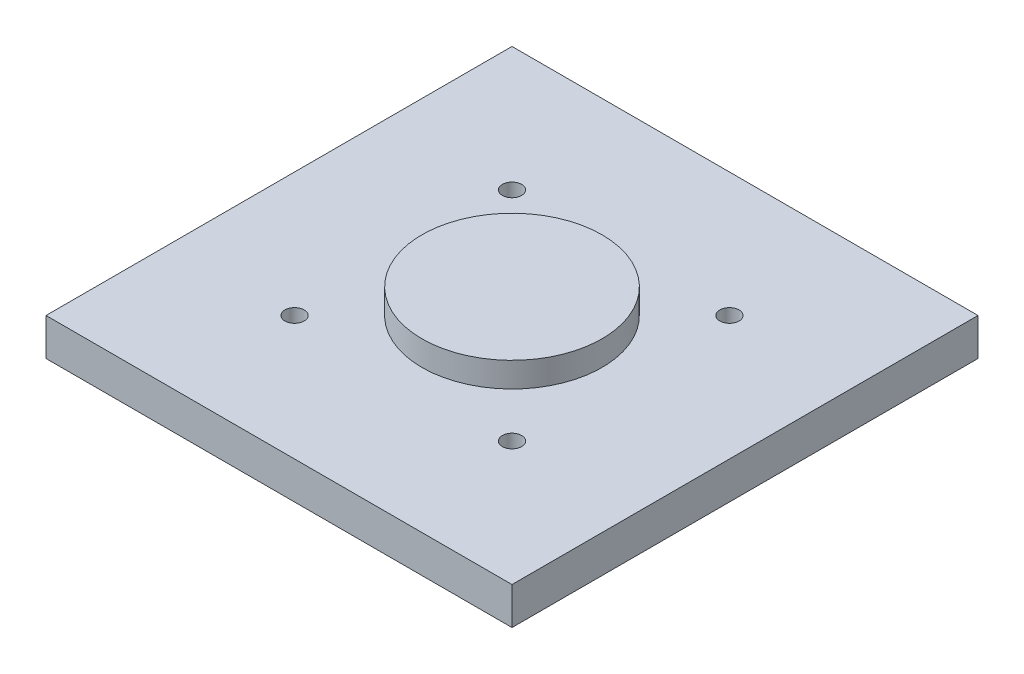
ISO-10303-21;
HEADER;
FILE_DESCRIPTION(('STEP AP214'),'2;1');
FILE_NAME('part.step','',(''),(''),'','','');
FILE_SCHEMA(('AUTOMOTIVE_DESIGN { 1 0 10303 214 1 1 1 1 }'));
ENDSEC;
DATA;
#1=APPLICATION_CONTEXT('core data for automotive mechanical design processes');
#2=APPLICATION_PROTOCOL_DEFINITION('international standard','automotive_design',2000,#1);
#3=PRODUCT_CONTEXT('',#1,'mechanical');
#4=PRODUCT('Part','Part','',(#3));
#5=PRODUCT_RELATED_PRODUCT_CATEGORY('part','',(#4));
#6=PRODUCT_DEFINITION_FORMATION('','',#4);
#7=PRODUCT_DEFINITION_CONTEXT('part definition',#1,'design');
#8=PRODUCT_DEFINITION('design','',#6,#7);
#9=PRODUCT_DEFINITION_SHAPE('','',#8);
#10=(LENGTH_UNIT() NAMED_UNIT(*) SI_UNIT(.MILLI.,.METRE.));
#11=(NAMED_UNIT(*) PLANE_ANGLE_UNIT() SI_UNIT($,.RADIAN.));
#12=(NAMED_UNIT(*) SI_UNIT($,.STERADIAN.) SOLID_ANGLE_UNIT());
#13=UNCERTAINTY_MEASURE_WITH_UNIT(LENGTH_MEASURE(1.E-05),#10,'distance_accuracy_value','');
#14=(GEOMETRIC_REPRESENTATION_CONTEXT(3) GLOBAL_UNCERTAINTY_ASSIGNED_CONTEXT((#13)) GLOBAL_UNIT_ASSIGNED_CONTEXT((#10,
#11,#12)) REPRESENTATION_CONTEXT('',''));
#15=CARTESIAN_POINT('',(0.,0.,0.));
#16=DIRECTION('',(0.,0.,1.));
#17=DIRECTION('',(1.,0.,0.));
#18=AXIS2_PLACEMENT_3D('',#15,#16,#17);
#19=CARTESIAN_POINT('',(-342.307692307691,-652.692307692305,375.));
#20=DIRECTION('',(1.,0.,0.));
#21=DIRECTION('',(0.,0.,-1.));
#22=AXIS2_PLACEMENT_3D('',#19,#20,#21);
#23=PLANE('',#22);
#24=DIRECTION('',(0.,-1.,0.));
#25=VECTOR('',#24,1.);
#26=CARTESIAN_POINT('',(-342.307692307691,-652.692307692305,0.));
#27=LINE('',#26,#25);
#28=CARTESIAN_POINT('',(-342.307692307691,-652.692307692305,0.));
#29=VERTEX_POINT('',#28);
#30=CARTESIAN_POINT('',(-342.307692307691,-682.692307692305,0.));
#31=VERTEX_POINT('',#30);
#32=EDGE_CURVE('E119',#29,#31,#27,.T.);
#33=ORIENTED_EDGE('',*,*,#32,.T.);
#34=DIRECTION('',(0.,0.,-1.));
#35=VECTOR('',#34,1.);
#36=CARTESIAN_POINT('',(-342.307692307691,-682.692307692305,375.));
#37=LINE('',#36,#35);
#38=CARTESIAN_POINT('',(-342.307692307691,-682.692307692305,375.));
#39=VERTEX_POINT('',#38);
#40=EDGE_CURVE('E61',#39,#31,#37,.T.);
#41=ORIENTED_EDGE('',*,*,#40,.F.);
#42=DIRECTION('',(0.,-1.,0.));
#43=VECTOR('',#42,1.);
#44=CARTESIAN_POINT('',(-342.307692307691,-652.692307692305,375.));
#45=LINE('',#44,#43);
#46=CARTESIAN_POINT('',(-342.307692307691,-652.692307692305,375.));
#47=VERTEX_POINT('',#46);
#48=EDGE_CURVE('E105',#47,#39,#45,.T.);
#49=ORIENTED_EDGE('',*,*,#48,.F.);
#50=DIRECTION('',(0.,0.,-1.));
#51=VECTOR('',#50,1.);
#52=CARTESIAN_POINT('',(-342.307692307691,-652.692307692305,375.));
#53=LINE('',#52,#51);
#54=EDGE_CURVE('E115',#47,#29,#53,.T.);
#55=ORIENTED_EDGE('',*,*,#54,.T.);
#56=EDGE_LOOP('',(#33,#41,#49,#55));
#57=FACE_BOUND('',#56,.T.);
#58=ADVANCED_FACE('F53',(#57),#23,.F.);
#59=CARTESIAN_POINT('',(32.692307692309,-682.692307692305,375.));
#60=DIRECTION('',(0.,1.,0.));
#61=DIRECTION('',(-1.,0.,0.));
#62=AXIS2_PLACEMENT_3D('',#59,#60,#61);
#63=PLANE('',#62);
#64=CARTESIAN_POINT('',(-67.307692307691,-682.692307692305,100.));
#65=DIRECTION('',(0.,1.,0.));
#66=DIRECTION('',(0.,0.,1.));
#67=AXIS2_PLACEMENT_3D('',#64,#65,#66);
#68=CIRCLE('',#67,7.74999999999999);
#69=CARTESIAN_POINT('',(-67.307692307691,-682.692307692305,107.75));
#70=VERTEX_POINT('',#69);
#71=EDGE_CURVE('E189',#70,#70,#68,.T.);
#72=ORIENTED_EDGE('',*,*,#71,.T.);
#73=EDGE_LOOP('',(#72));
#74=FACE_BOUND('',#73,.T.);
#75=CARTESIAN_POINT('',(-242.307692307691,-682.692307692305,100.));
#76=DIRECTION('',(0.,1.,0.));
#77=DIRECTION('',(0.,0.,1.));
#78=AXIS2_PLACEMENT_3D('',#75,#76,#77);
#79=CIRCLE('',#78,7.75000000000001);
#80=CARTESIAN_POINT('',(-242.307692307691,-682.692307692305,107.75));
#81=VERTEX_POINT('',#80);
#82=EDGE_CURVE('E185',#81,#81,#79,.T.);
#83=ORIENTED_EDGE('',*,*,#82,.T.);
#84=EDGE_LOOP('',(#83));
#85=FACE_BOUND('',#84,.T.);
#86=CARTESIAN_POINT('',(-242.307692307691,-682.692307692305,275.));
#87=DIRECTION('',(0.,1.,0.));
#88=DIRECTION('',(0.,0.,1.));
#89=AXIS2_PLACEMENT_3D('',#86,#87,#88);
#90=CIRCLE('',#89,7.75000000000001);
#91=CARTESIAN_POINT('',(-242.307692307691,-682.692307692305,282.75));
#92=VERTEX_POINT('',#91);
#93=EDGE_CURVE('E177',#92,#92,#90,.T.);
#94=ORIENTED_EDGE('',*,*,#93,.T.);
#95=EDGE_LOOP('',(#94));
#96=FACE_BOUND('',#95,.T.);
#97=CARTESIAN_POINT('',(-67.307692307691,-682.692307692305,275.));
#98=DIRECTION('',(0.,1.,0.));
#99=DIRECTION('',(0.,0.,1.));
#100=AXIS2_PLACEMENT_3D('',#97,#98,#99);
#101=CIRCLE('',#100,7.74999999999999);
#102=CARTESIAN_POINT('',(-67.307692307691,-682.692307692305,282.75));
#103=VERTEX_POINT('',#102);
#104=EDGE_CURVE('E122',#103,#103,#101,.T.);
#105=ORIENTED_EDGE('',*,*,#104,.T.);
#106=EDGE_LOOP('',(#105));
#107=FACE_BOUND('',#106,.T.);
#108=DIRECTION('',(1.,0.,0.));
#109=VECTOR('',#108,1.);
#110=CARTESIAN_POINT('',(32.692307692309,-682.692307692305,0.));
#111=LINE('',#110,#109);
#112=CARTESIAN_POINT('',(32.692307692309,-682.692307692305,0.));
#113=VERTEX_POINT('',#112);
#114=EDGE_CURVE('E110',#31,#113,#111,.T.);
#115=ORIENTED_EDGE('',*,*,#114,.T.);
#116=DIRECTION('',(0.,0.,-1.));
#117=VECTOR('',#116,1.);
#118=CARTESIAN_POINT('',(32.692307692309,-682.692307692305,375.));
#119=LINE('',#118,#117);
#120=CARTESIAN_POINT('',(32.692307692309,-682.692307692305,375.));
#121=VERTEX_POINT('',#120);
#122=EDGE_CURVE('E108',#121,#113,#119,.T.);
#123=ORIENTED_EDGE('',*,*,#122,.F.);
#124=DIRECTION('',(1.,0.,0.));
#125=VECTOR('',#124,1.);
#126=CARTESIAN_POINT('',(32.692307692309,-682.692307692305,375.));
#127=LINE('',#126,#125);
#128=EDGE_CURVE('E100',#39,#121,#127,.T.);
#129=ORIENTED_EDGE('',*,*,#128,.F.);
#130=ORIENTED_EDGE('',*,*,#40,.T.);
#131=EDGE_LOOP('',(#115,#123,#129,#130));
#132=FACE_BOUND('',#131,.T.);
#133=ADVANCED_FACE('F109',(#74,#85,#96,#107,#132),#63,.F.);
#134=CARTESIAN_POINT('',(32.692307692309,-652.692307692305,375.));
#135=DIRECTION('',(-1.,0.,0.));
#136=DIRECTION('',(0.,0.,1.));
#137=AXIS2_PLACEMENT_3D('',#134,#135,#136);
#138=PLANE('',#137);
#139=DIRECTION('',(0.,1.,0.));
#140=VECTOR('',#139,1.);
#141=CARTESIAN_POINT('',(32.692307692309,-652.692307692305,0.));
#142=LINE('',#141,#140);
#143=CARTESIAN_POINT('',(32.692307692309,-652.692307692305,0.));
#144=VERTEX_POINT('',#143);
#145=EDGE_CURVE('E86',#113,#144,#142,.T.);
#146=ORIENTED_EDGE('',*,*,#145,.T.);
#147=DIRECTION('',(0.,0.,-1.));
#148=VECTOR('',#147,1.);
#149=CARTESIAN_POINT('',(32.692307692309,-652.692307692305,375.));
#150=LINE('',#149,#148);
#151=CARTESIAN_POINT('',(32.692307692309,-652.692307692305,375.));
#152=VERTEX_POINT('',#151);
#153=EDGE_CURVE('E111',#152,#144,#150,.T.);
#154=ORIENTED_EDGE('',*,*,#153,.F.);
#155=DIRECTION('',(0.,1.,0.));
#156=VECTOR('',#155,1.);
#157=CARTESIAN_POINT('',(32.692307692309,-652.692307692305,375.));
#158=LINE('',#157,#156);
#159=EDGE_CURVE('E103',#121,#152,#158,.T.);
#160=ORIENTED_EDGE('',*,*,#159,.F.);
#161=ORIENTED_EDGE('',*,*,#122,.T.);
#162=EDGE_LOOP('',(#146,#154,#160,#161));
#163=FACE_BOUND('',#162,.T.);
#164=ADVANCED_FACE('F113',(#163),#138,.F.);
#165=CARTESIAN_POINT('',(32.692307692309,-652.692307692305,375.));
#166=DIRECTION('',(0.,-1.,0.));
#167=DIRECTION('',(0.,0.,-1.));
#168=AXIS2_PLACEMENT_3D('',#165,#166,#167);
#169=PLANE('',#168);
#170=CARTESIAN_POINT('',(-154.807692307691,-652.692307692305,187.5));
#171=DIRECTION('',(0.,-1.,0.));
#172=DIRECTION('',(0.,0.,-1.));
#173=AXIS2_PLACEMENT_3D('',#170,#171,#172);
#174=CIRCLE('',#173,72.5);
#175=CARTESIAN_POINT('',(-154.807692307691,-652.692307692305,115.));
#176=VERTEX_POINT('',#175);
#177=EDGE_CURVE('E13',#176,#176,#174,.F.);
#178=ORIENTED_EDGE('',*,*,#177,.F.);
#179=EDGE_LOOP('',(#178));
#180=FACE_BOUND('',#179,.T.);
#181=CARTESIAN_POINT('',(-67.307692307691,-652.692307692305,100.));
#182=DIRECTION('',(0.,1.,0.));
#183=DIRECTION('',(0.,0.,1.));
#184=AXIS2_PLACEMENT_3D('',#181,#182,#183);
#185=CIRCLE('',#184,7.75);
#186=CARTESIAN_POINT('',(-67.307692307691,-652.692307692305,107.75));
#187=VERTEX_POINT('',#186);
#188=EDGE_CURVE('E164',#187,#187,#185,.T.);
#189=ORIENTED_EDGE('',*,*,#188,.F.);
#190=EDGE_LOOP('',(#189));
#191=FACE_BOUND('',#190,.T.);
#192=CARTESIAN_POINT('',(-242.307692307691,-652.692307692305,100.));
#193=DIRECTION('',(0.,1.,0.));
#194=DIRECTION('',(0.,0.,1.));
#195=AXIS2_PLACEMENT_3D('',#192,#193,#194);
#196=CIRCLE('',#195,7.75000000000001);
#197=CARTESIAN_POINT('',(-242.307692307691,-652.692307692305,107.75));
#198=VERTEX_POINT('',#197);
#199=EDGE_CURVE('E168',#198,#198,#196,.T.);
#200=ORIENTED_EDGE('',*,*,#199,.F.);
#201=EDGE_LOOP('',(#200));
#202=FACE_BOUND('',#201,.T.);
#203=CARTESIAN_POINT('',(-242.307692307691,-652.692307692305,275.));
#204=DIRECTION('',(0.,1.,0.));
#205=DIRECTION('',(0.,0.,1.));
#206=AXIS2_PLACEMENT_3D('',#203,#204,#205);
#207=CIRCLE('',#206,7.75000000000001);
#208=CARTESIAN_POINT('',(-242.307692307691,-652.692307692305,282.75));
#209=VERTEX_POINT('',#208);
#210=EDGE_CURVE('E172',#209,#209,#207,.T.);
#211=ORIENTED_EDGE('',*,*,#210,.F.);
#212=EDGE_LOOP('',(#211));
#213=FACE_BOUND('',#212,.T.);
#214=CARTESIAN_POINT('',(-67.307692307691,-652.692307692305,275.));
#215=DIRECTION('',(0.,1.,0.));
#216=DIRECTION('',(0.,0.,1.));
#217=AXIS2_PLACEMENT_3D('',#214,#215,#216);
#218=CIRCLE('',#217,7.75);
#219=CARTESIAN_POINT('',(-67.307692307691,-652.692307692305,282.75));
#220=VERTEX_POINT('',#219);
#221=EDGE_CURVE('E175',#220,#220,#218,.T.);
#222=ORIENTED_EDGE('',*,*,#221,.F.);
#223=EDGE_LOOP('',(#222));
#224=FACE_BOUND('',#223,.T.);
#225=DIRECTION('',(-1.,0.,0.));
#226=VECTOR('',#225,1.);
#227=CARTESIAN_POINT('',(32.692307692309,-652.692307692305,0.));
#228=LINE('',#227,#226);
#229=EDGE_CURVE('E92',#144,#29,#228,.T.);
#230=ORIENTED_EDGE('',*,*,#229,.T.);
#231=ORIENTED_EDGE('',*,*,#54,.F.);
#232=DIRECTION('',(-1.,0.,0.));
#233=VECTOR('',#232,1.);
#234=CARTESIAN_POINT('',(32.692307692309,-652.692307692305,375.));
#235=LINE('',#234,#233);
#236=EDGE_CURVE('E69',#152,#47,#235,.T.);
#237=ORIENTED_EDGE('',*,*,#236,.F.);
#238=ORIENTED_EDGE('',*,*,#153,.T.);
#239=EDGE_LOOP('',(#230,#231,#237,#238));
#240=FACE_BOUND('',#239,.T.);
#241=ADVANCED_FACE('F141',(#180,#191,#202,#213,#224,#240),#169,.F.);
#242=CARTESIAN_POINT('',(0.,0.,375.));
#243=DIRECTION('',(0.,0.,-1.));
#244=DIRECTION('',(-1.,0.,0.));
#245=AXIS2_PLACEMENT_3D('',#242,#243,#244);
#246=PLANE('',#245);
#247=ORIENTED_EDGE('',*,*,#48,.T.);
#248=ORIENTED_EDGE('',*,*,#128,.T.);
#249=ORIENTED_EDGE('',*,*,#159,.T.);
#250=ORIENTED_EDGE('',*,*,#236,.T.);
#251=EDGE_LOOP('',(#247,#248,#249,#250));
#252=FACE_BOUND('',#251,.T.);
#253=ADVANCED_FACE('F101',(#252),#246,.F.);
#254=CARTESIAN_POINT('',(0.,0.,0.));
#255=DIRECTION('',(0.,0.,-1.));
#256=DIRECTION('',(-1.,0.,0.));
#257=AXIS2_PLACEMENT_3D('',#254,#255,#256);
#258=PLANE('',#257);
#259=ORIENTED_EDGE('',*,*,#32,.F.);
#260=ORIENTED_EDGE('',*,*,#229,.F.);
#261=ORIENTED_EDGE('',*,*,#145,.F.);
#262=ORIENTED_EDGE('',*,*,#114,.F.);
#263=EDGE_LOOP('',(#259,#260,#261,#262));
#264=FACE_BOUND('',#263,.T.);
#265=ADVANCED_FACE('F130',(#264),#258,.T.);
#266=CARTESIAN_POINT('',(-67.307692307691,-652.692307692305,275.));
#267=DIRECTION('',(0.,1.,0.));
#268=DIRECTION('',(0.,0.,1.));
#269=AXIS2_PLACEMENT_3D('',#266,#267,#268);
#270=CYLINDRICAL_SURFACE('',#269,7.75);
#271=ORIENTED_EDGE('',*,*,#104,.F.);
#272=EDGE_LOOP('',(#271));
#273=FACE_BOUND('',#272,.T.);
#274=ORIENTED_EDGE('',*,*,#221,.T.);
#275=EDGE_LOOP('',(#274));
#276=FACE_BOUND('',#275,.T.);
#277=ADVANCED_FACE('F132',(#273,#276),#270,.F.);
#278=CARTESIAN_POINT('',(-242.307692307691,-652.692307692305,275.));
#279=DIRECTION('',(0.,1.,0.));
#280=DIRECTION('',(0.,0.,1.));
#281=AXIS2_PLACEMENT_3D('',#278,#279,#280);
#282=CYLINDRICAL_SURFACE('',#281,7.75000000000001);
#283=ORIENTED_EDGE('',*,*,#93,.F.);
#284=EDGE_LOOP('',(#283));
#285=FACE_BOUND('',#284,.T.);
#286=ORIENTED_EDGE('',*,*,#210,.T.);
#287=EDGE_LOOP('',(#286));
#288=FACE_BOUND('',#287,.T.);
#289=ADVANCED_FACE('F138',(#285,#288),#282,.F.);
#290=CARTESIAN_POINT('',(-242.307692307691,-652.692307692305,100.));
#291=DIRECTION('',(0.,1.,0.));
#292=DIRECTION('',(0.,0.,1.));
#293=AXIS2_PLACEMENT_3D('',#290,#291,#292);
#294=CYLINDRICAL_SURFACE('',#293,7.75000000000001);
#295=ORIENTED_EDGE('',*,*,#82,.F.);
#296=EDGE_LOOP('',(#295));
#297=FACE_BOUND('',#296,.T.);
#298=ORIENTED_EDGE('',*,*,#199,.T.);
#299=EDGE_LOOP('',(#298));
#300=FACE_BOUND('',#299,.T.);
#301=ADVANCED_FACE('F208',(#297,#300),#294,.F.);
#302=CARTESIAN_POINT('',(-67.307692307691,-652.692307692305,100.));
#303=DIRECTION('',(0.,1.,0.));
#304=DIRECTION('',(0.,0.,1.));
#305=AXIS2_PLACEMENT_3D('',#302,#303,#304);
#306=CYLINDRICAL_SURFACE('',#305,7.75);
#307=ORIENTED_EDGE('',*,*,#71,.F.);
#308=EDGE_LOOP('',(#307));
#309=FACE_BOUND('',#308,.T.);
#310=ORIENTED_EDGE('',*,*,#188,.T.);
#311=EDGE_LOOP('',(#310));
#312=FACE_BOUND('',#311,.T.);
#313=ADVANCED_FACE('F201',(#309,#312),#306,.F.);
#314=CARTESIAN_POINT('',(-154.807692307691,-632.692307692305,187.5));
#315=DIRECTION('',(0.,-1.,0.));
#316=DIRECTION('',(0.,0.,-1.));
#317=AXIS2_PLACEMENT_3D('',#314,#315,#316);
#318=CYLINDRICAL_SURFACE('',#317,72.5);
#319=CARTESIAN_POINT('',(-154.807692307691,-632.692307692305,187.5));
#320=DIRECTION('',(0.,1.,0.));
#321=DIRECTION('',(0.,0.,1.));
#322=AXIS2_PLACEMENT_3D('',#319,#320,#321);
#323=CIRCLE('',#322,72.5);
#324=CARTESIAN_POINT('',(-154.807692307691,-632.692307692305,260.));
#325=VERTEX_POINT('',#324);
#326=EDGE_CURVE('E192',#325,#325,#323,.T.);
#327=ORIENTED_EDGE('',*,*,#326,.F.);
#328=EDGE_LOOP('',(#327));
#329=FACE_BOUND('',#328,.T.);
#330=ORIENTED_EDGE('',*,*,#177,.T.);
#331=EDGE_LOOP('',(#330));
#332=FACE_BOUND('',#331,.T.);
#333=ADVANCED_FACE('F198',(#329,#332),#318,.T.);
#334=CARTESIAN_POINT('',(0.,-632.692307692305,0.));
#335=DIRECTION('',(0.,1.,0.));
#336=DIRECTION('',(0.,0.,1.));
#337=AXIS2_PLACEMENT_3D('',#334,#335,#336);
#338=PLANE('',#337);
#339=ORIENTED_EDGE('',*,*,#326,.T.);
#340=EDGE_LOOP('',(#339));
#341=FACE_BOUND('',#340,.T.);
#342=ADVANCED_FACE('F196',(#341),#338,.T.);
#343=CLOSED_SHELL('',(#58,#133,#164,#241,#253,#265,#277,#289,#301,#313,#333,#342));
#344=MANIFOLD_SOLID_BREP('B2',#343);
#345=ADVANCED_BREP_SHAPE_REPRESENTATION('',(#18,#344),#14);
#346=SHAPE_DEFINITION_REPRESENTATION(#9,#345);
ENDSEC;
END-ISO-10303-21;
